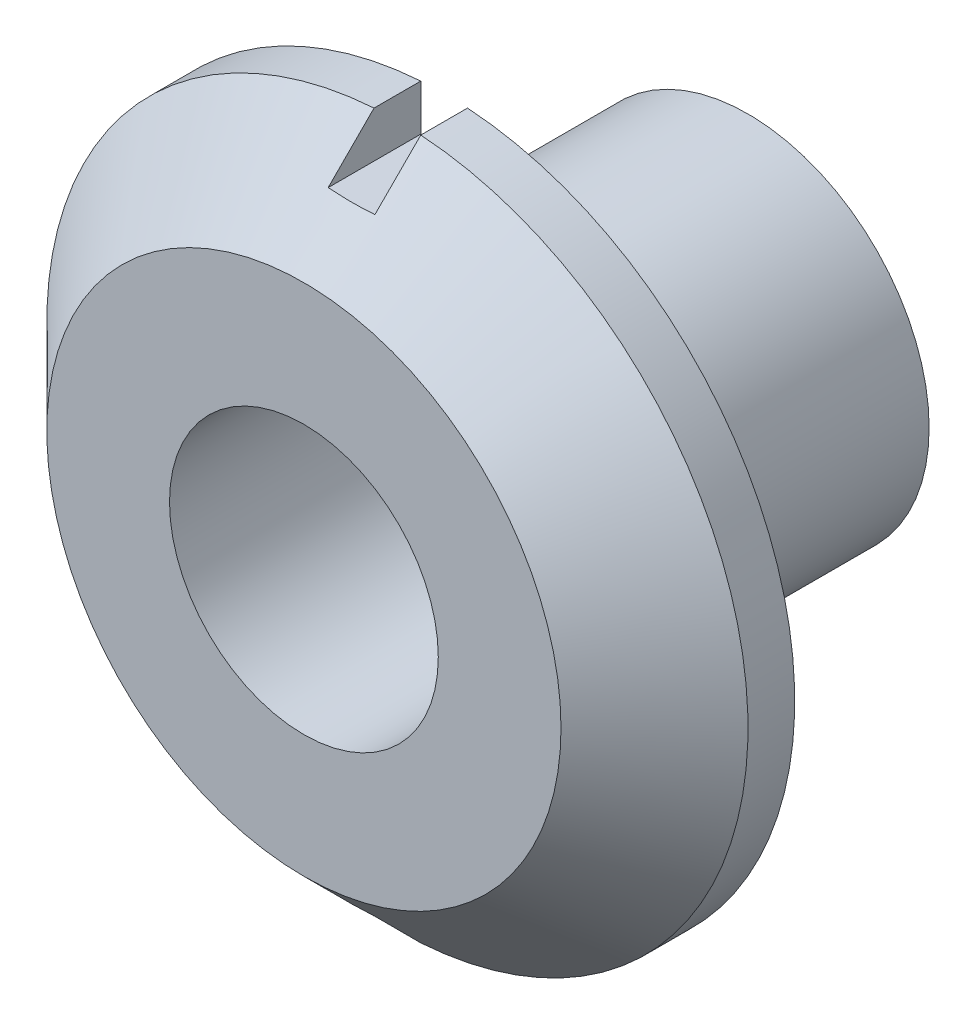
from build123d import *
from build123d.topology import SkipClean

# Parameters (mm, degrees)
CROQUIS1_R              = 7.5
CROQUIS1_R_2            = 1.55
SALIENTE_EXTRUIR1_DEPTH = 1.5
CHAFL_N1_SIZE           = 2
SALIENTE_EXTRUIR2_START = 6.5
CROQUIS2_R              = 3.875
CROQUIS2_R_2            = 1.55
SALIENTE_EXTRUIR2_DEPTH = 6.5
CROQUIS3_R              = 2.875
CORTAR_EXTRUIR1_DEPTH   = 6.5
CROQUIS4_W              = 1
CROQUIS4_H              = 2
CORTAR_EXTRUIR2_DEPTH   = 15.239030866


with BuildPart() as part:
    # Croquis1 → Saliente-Extruir1 (new, symmetric)
    with BuildSketch(Plane.XY):
        Circle(CROQUIS1_R)
        Circle(CROQUIS1_R_2, mode=Mode.SUBTRACT)
    extrude(amount=SALIENTE_EXTRUIR1_DEPTH, both=True)

    # Chafl_n1
    chafl_n1_edges = [part.edges().sort_by_distance(p)[0] for p in [
        (-7.5, 0, 1.5),
    ]]
    chamfer(chafl_n1_edges, length=CHAFL_N1_SIZE)

    # Croquis2 → Saliente-Extruir2 (add)
    with SkipClean():  # the faces are left unmerged after this step: merging them gives an invalid solid
        with BuildSketch(Plane(origin=(0, 0, -1.5), x_dir=(-1, 0, 0), z_dir=(0, 0, -1)).offset(SALIENTE_EXTRUIR2_START)):
            with Locations(Location((0, 0, 0), (0, 0, 180))):
                Circle(CROQUIS2_R)
            Circle(CROQUIS2_R_2, mode=Mode.SUBTRACT)
        extrude(amount=-SALIENTE_EXTRUIR2_DEPTH)

    # Croquis3 → Cortar-Extruir1 (cut)
    with BuildSketch(Plane.XY.offset(1.5)):
        Circle(CROQUIS3_R)
    extrude(amount=-CORTAR_EXTRUIR1_DEPTH, mode=Mode.SUBTRACT)

    # Croquis4 → Cortar-Extruir2 (cut, through all)
    with BuildSketch(Plane.XY.offset(1.5)):
        with Locations((0, 7.5)):
            Rectangle(CROQUIS4_W, CROQUIS4_H)
        with Locations((0, -7.5)):
            Rectangle(CROQUIS4_W, CROQUIS4_H)
    extrude(amount=-CORTAR_EXTRUIR2_DEPTH, mode=Mode.SUBTRACT)


solid = part.part
